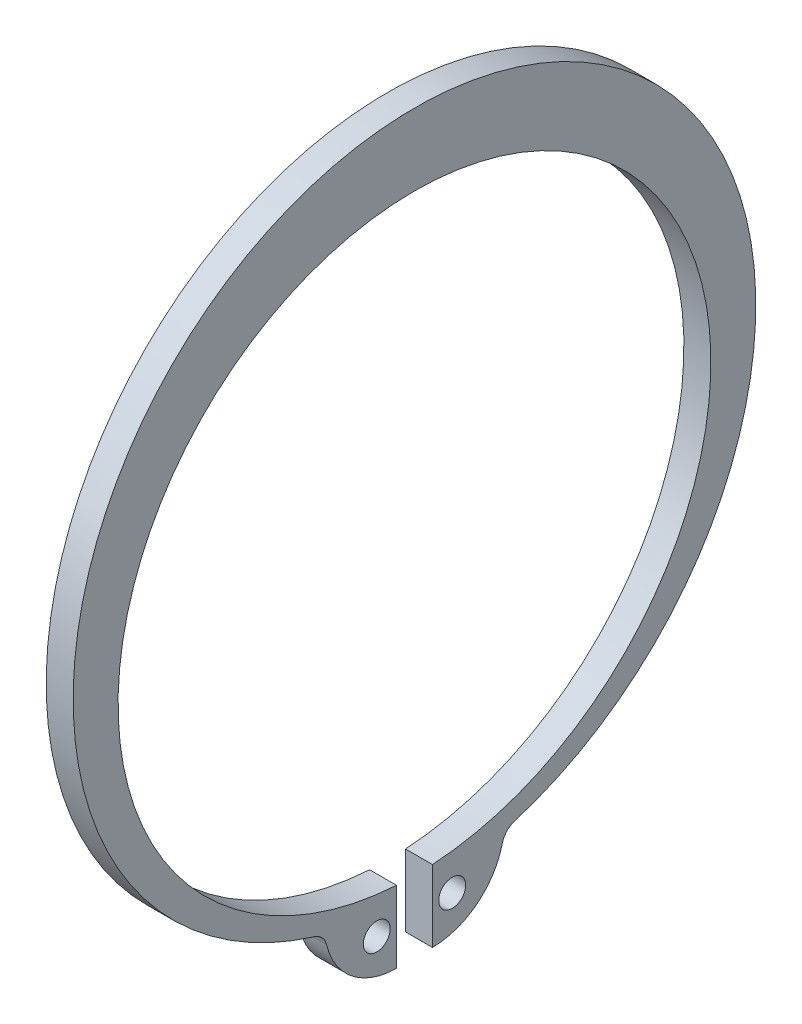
ISO-10303-21;
HEADER;
FILE_DESCRIPTION(('STEP AP214'),'2;1');
FILE_NAME('part.step','',(''),(''),'','','');
FILE_SCHEMA(('AUTOMOTIVE_DESIGN { 1 0 10303 214 1 1 1 1 }'));
ENDSEC;
DATA;
#1=APPLICATION_CONTEXT('core data for automotive mechanical design processes');
#2=APPLICATION_PROTOCOL_DEFINITION('international standard','automotive_design',2000,#1);
#3=PRODUCT_CONTEXT('',#1,'mechanical');
#4=PRODUCT('Part','Part','',(#3));
#5=PRODUCT_RELATED_PRODUCT_CATEGORY('part','',(#4));
#6=PRODUCT_DEFINITION_FORMATION('','',#4);
#7=PRODUCT_DEFINITION_CONTEXT('part definition',#1,'design');
#8=PRODUCT_DEFINITION('design','',#6,#7);
#9=PRODUCT_DEFINITION_SHAPE('','',#8);
#10=(LENGTH_UNIT() NAMED_UNIT(*) SI_UNIT(.MILLI.,.METRE.));
#11=(NAMED_UNIT(*) PLANE_ANGLE_UNIT() SI_UNIT($,.RADIAN.));
#12=(NAMED_UNIT(*) SI_UNIT($,.STERADIAN.) SOLID_ANGLE_UNIT());
#13=UNCERTAINTY_MEASURE_WITH_UNIT(LENGTH_MEASURE(1.E-05),#10,'distance_accuracy_value','');
#14=(GEOMETRIC_REPRESENTATION_CONTEXT(3) GLOBAL_UNCERTAINTY_ASSIGNED_CONTEXT((#13)) GLOBAL_UNIT_ASSIGNED_CONTEXT((#10,
#11,#12)) REPRESENTATION_CONTEXT('',''));
#15=CARTESIAN_POINT('',(0.,0.,0.));
#16=DIRECTION('',(0.,0.,1.));
#17=DIRECTION('',(1.,0.,0.));
#18=AXIS2_PLACEMENT_3D('',#15,#16,#17);
#19=CARTESIAN_POINT('',(1.5,1.5,0.));
#20=DIRECTION('',(1.,0.,0.));
#21=DIRECTION('',(0.,0.,-1.));
#22=AXIS2_PLACEMENT_3D('',#19,#20,#21);
#23=PLANE('',#22);
#24=CARTESIAN_POINT('',(1.5,-18.3847255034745,2.1));
#25=DIRECTION('',(1.,0.,0.));
#26=DIRECTION('',(0.,0.,-1.));
#27=AXIS2_PLACEMENT_3D('',#24,#25,#26);
#28=CIRCLE('',#27,0.75);
#29=CARTESIAN_POINT('',(1.5,-18.3847255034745,1.35));
#30=VERTEX_POINT('',#29);
#31=EDGE_CURVE('E115',#30,#30,#28,.T.);
#32=ORIENTED_EDGE('',*,*,#31,.F.);
#33=EDGE_LOOP('',(#32));
#34=FACE_BOUND('',#33,.T.);
#35=CARTESIAN_POINT('',(1.5,1.5,0.));
#36=DIRECTION('',(1.,0.,0.));
#37=DIRECTION('',(0.,0.,-1.));
#38=AXIS2_PLACEMENT_3D('',#35,#36,#37);
#39=CIRCLE('',#38,19.);
#40=CARTESIAN_POINT('',(1.5,-16.6644583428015,-5.57247280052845));
#41=VERTEX_POINT('',#40);
#42=CARTESIAN_POINT('',(1.5,-16.6644583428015,5.57247280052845));
#43=VERTEX_POINT('',#42);
#44=EDGE_CURVE('E133',#41,#43,#39,.T.);
#45=ORIENTED_EDGE('',*,*,#44,.T.);
#46=CARTESIAN_POINT('',(1.5,-17.6204824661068,5.86576084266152));
#47=DIRECTION('',(-1.,0.,0.));
#48=DIRECTION('',(0.,0.,1.));
#49=AXIS2_PLACEMENT_3D('',#46,#47,#48);
#50=CIRCLE('',#49,1.);
#51=CARTESIAN_POINT('',(1.5,-17.3903197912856,4.89260867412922));
#52=VERTEX_POINT('',#51);
#53=EDGE_CURVE('E110',#43,#52,#50,.T.);
#54=ORIENTED_EDGE('',*,*,#53,.T.);
#55=CARTESIAN_POINT('',(1.5,-16.4696690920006,1.));
#56=DIRECTION('',(1.,0.,0.));
#57=DIRECTION('',(0.,0.,-1.));
#58=AXIS2_PLACEMENT_3D('',#55,#56,#57);
#59=CIRCLE('',#58,4.);
#60=CARTESIAN_POINT('',(1.5,-20.4696690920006,1.));
#61=VERTEX_POINT('',#60);
#62=EDGE_CURVE('E136',#52,#61,#59,.T.);
#63=ORIENTED_EDGE('',*,*,#62,.T.);
#64=DIRECTION('',(0.,1.,0.));
#65=VECTOR('',#64,1.);
#66=CARTESIAN_POINT('',(1.5,-16.4696690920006,1.));
#67=LINE('',#66,#65);
#68=CARTESIAN_POINT('',(1.5,-16.4696690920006,1.));
#69=VERTEX_POINT('',#68);
#70=EDGE_CURVE('E138',#61,#69,#67,.T.);
#71=ORIENTED_EDGE('',*,*,#70,.T.);
#72=CARTESIAN_POINT('',(1.5,0.,0.));
#73=DIRECTION('',(-1.,0.,0.));
#74=DIRECTION('',(0.,0.,-1.));
#75=AXIS2_PLACEMENT_3D('',#72,#73,#74);
#76=CIRCLE('',#75,16.5);
#77=CARTESIAN_POINT('',(1.5,-16.4696690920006,-0.99999999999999));
#78=VERTEX_POINT('',#77);
#79=EDGE_CURVE('E140',#69,#78,#76,.T.);
#80=ORIENTED_EDGE('',*,*,#79,.T.);
#81=DIRECTION('',(0.,-1.,0.));
#82=VECTOR('',#81,1.);
#83=CARTESIAN_POINT('',(1.5,-16.4696690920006,-1.));
#84=LINE('',#83,#82);
#85=CARTESIAN_POINT('',(1.5,-20.4696690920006,-1.));
#86=VERTEX_POINT('',#85);
#87=EDGE_CURVE('E142',#78,#86,#84,.T.);
#88=ORIENTED_EDGE('',*,*,#87,.T.);
#89=CARTESIAN_POINT('',(1.5,-16.4696690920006,-1.));
#90=DIRECTION('',(1.,0.,0.));
#91=DIRECTION('',(0.,0.,-1.));
#92=AXIS2_PLACEMENT_3D('',#89,#90,#91);
#93=CIRCLE('',#92,4.);
#94=CARTESIAN_POINT('',(1.5,-17.3903197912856,-4.89260867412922));
#95=VERTEX_POINT('',#94);
#96=EDGE_CURVE('E51',#86,#95,#93,.T.);
#97=ORIENTED_EDGE('',*,*,#96,.T.);
#98=CARTESIAN_POINT('',(1.5,-17.6204824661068,-5.86576084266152));
#99=DIRECTION('',(-1.,0.,0.));
#100=DIRECTION('',(0.,0.,-1.));
#101=AXIS2_PLACEMENT_3D('',#98,#99,#100);
#102=CIRCLE('',#101,1.);
#103=EDGE_CURVE('E46',#95,#41,#102,.T.);
#104=ORIENTED_EDGE('',*,*,#103,.T.);
#105=EDGE_LOOP('',(#45,#54,#63,#71,#80,#88,#97,#104));
#106=FACE_BOUND('',#105,.T.);
#107=CARTESIAN_POINT('',(1.5,-18.3847255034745,-2.1));
#108=DIRECTION('',(1.,0.,0.));
#109=DIRECTION('',(0.,0.,-1.));
#110=AXIS2_PLACEMENT_3D('',#107,#108,#109);
#111=CIRCLE('',#110,0.75);
#112=CARTESIAN_POINT('',(1.5,-18.3847255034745,-2.85));
#113=VERTEX_POINT('',#112);
#114=EDGE_CURVE('E213',#113,#113,#111,.T.);
#115=ORIENTED_EDGE('',*,*,#114,.F.);
#116=EDGE_LOOP('',(#115));
#117=FACE_BOUND('',#116,.T.);
#118=ADVANCED_FACE('F31',(#34,#106,#117),#23,.T.);
#119=CARTESIAN_POINT('',(0.,1.5,0.));
#120=DIRECTION('',(1.,0.,0.));
#121=DIRECTION('',(0.,0.,-1.));
#122=AXIS2_PLACEMENT_3D('',#119,#120,#121);
#123=PLANE('',#122);
#124=CARTESIAN_POINT('',(0.,-18.3847255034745,2.1));
#125=DIRECTION('',(1.,0.,0.));
#126=DIRECTION('',(0.,0.,-1.));
#127=AXIS2_PLACEMENT_3D('',#124,#125,#126);
#128=CIRCLE('',#127,0.75);
#129=CARTESIAN_POINT('',(0.,-18.3847255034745,1.35));
#130=VERTEX_POINT('',#129);
#131=EDGE_CURVE('E118',#130,#130,#128,.T.);
#132=ORIENTED_EDGE('',*,*,#131,.T.);
#133=EDGE_LOOP('',(#132));
#134=FACE_BOUND('',#133,.T.);
#135=CARTESIAN_POINT('',(0.,1.5,0.));
#136=DIRECTION('',(1.,0.,0.));
#137=DIRECTION('',(0.,0.,-1.));
#138=AXIS2_PLACEMENT_3D('',#135,#136,#137);
#139=CIRCLE('',#138,19.);
#140=CARTESIAN_POINT('',(0.,-16.6644583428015,-5.57247280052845));
#141=VERTEX_POINT('',#140);
#142=CARTESIAN_POINT('',(0.,-16.6644583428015,5.57247280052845));
#143=VERTEX_POINT('',#142);
#144=EDGE_CURVE('E101',#141,#143,#139,.T.);
#145=ORIENTED_EDGE('',*,*,#144,.F.);
#146=CARTESIAN_POINT('',(0.,-17.6204824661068,-5.86576084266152));
#147=DIRECTION('',(-1.,0.,0.));
#148=DIRECTION('',(0.,0.,-1.));
#149=AXIS2_PLACEMENT_3D('',#146,#147,#148);
#150=CIRCLE('',#149,1.);
#151=CARTESIAN_POINT('',(0.,-17.3903197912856,-4.89260867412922));
#152=VERTEX_POINT('',#151);
#153=EDGE_CURVE('E131',#152,#141,#150,.T.);
#154=ORIENTED_EDGE('',*,*,#153,.F.);
#155=CARTESIAN_POINT('',(0.,-16.4696690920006,-1.));
#156=DIRECTION('',(1.,0.,0.));
#157=DIRECTION('',(0.,0.,-1.));
#158=AXIS2_PLACEMENT_3D('',#155,#156,#157);
#159=CIRCLE('',#158,4.);
#160=CARTESIAN_POINT('',(0.,-20.4696690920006,-1.));
#161=VERTEX_POINT('',#160);
#162=EDGE_CURVE('E129',#161,#152,#159,.T.);
#163=ORIENTED_EDGE('',*,*,#162,.F.);
#164=DIRECTION('',(0.,-1.,0.));
#165=VECTOR('',#164,1.);
#166=CARTESIAN_POINT('',(0.,-16.4696690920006,-1.));
#167=LINE('',#166,#165);
#168=CARTESIAN_POINT('',(0.,-16.4696690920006,-0.99999999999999));
#169=VERTEX_POINT('',#168);
#170=EDGE_CURVE('E127',#169,#161,#167,.T.);
#171=ORIENTED_EDGE('',*,*,#170,.F.);
#172=CARTESIAN_POINT('',(0.,0.,0.));
#173=DIRECTION('',(-1.,0.,0.));
#174=DIRECTION('',(0.,0.,-1.));
#175=AXIS2_PLACEMENT_3D('',#172,#173,#174);
#176=CIRCLE('',#175,16.5);
#177=CARTESIAN_POINT('',(0.,-16.4696690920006,1.));
#178=VERTEX_POINT('',#177);
#179=EDGE_CURVE('E125',#178,#169,#176,.T.);
#180=ORIENTED_EDGE('',*,*,#179,.F.);
#181=DIRECTION('',(0.,1.,0.));
#182=VECTOR('',#181,1.);
#183=CARTESIAN_POINT('',(0.,-16.4696690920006,1.));
#184=LINE('',#183,#182);
#185=CARTESIAN_POINT('',(0.,-20.4696690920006,1.));
#186=VERTEX_POINT('',#185);
#187=EDGE_CURVE('E123',#186,#178,#184,.T.);
#188=ORIENTED_EDGE('',*,*,#187,.F.);
#189=CARTESIAN_POINT('',(0.,-16.4696690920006,1.));
#190=DIRECTION('',(1.,0.,0.));
#191=DIRECTION('',(0.,0.,-1.));
#192=AXIS2_PLACEMENT_3D('',#189,#190,#191);
#193=CIRCLE('',#192,4.);
#194=CARTESIAN_POINT('',(0.,-17.3903197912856,4.89260867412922));
#195=VERTEX_POINT('',#194);
#196=EDGE_CURVE('E103',#195,#186,#193,.T.);
#197=ORIENTED_EDGE('',*,*,#196,.F.);
#198=CARTESIAN_POINT('',(0.,-17.6204824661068,5.86576084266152));
#199=DIRECTION('',(-1.,0.,0.));
#200=DIRECTION('',(0.,0.,1.));
#201=AXIS2_PLACEMENT_3D('',#198,#199,#200);
#202=CIRCLE('',#201,1.);
#203=EDGE_CURVE('E96',#143,#195,#202,.T.);
#204=ORIENTED_EDGE('',*,*,#203,.F.);
#205=EDGE_LOOP('',(#145,#154,#163,#171,#180,#188,#197,#204));
#206=FACE_BOUND('',#205,.T.);
#207=CARTESIAN_POINT('',(0.,-18.3847255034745,-2.1));
#208=DIRECTION('',(1.,0.,0.));
#209=DIRECTION('',(0.,0.,-1.));
#210=AXIS2_PLACEMENT_3D('',#207,#208,#209);
#211=CIRCLE('',#210,0.75);
#212=CARTESIAN_POINT('',(0.,-18.3847255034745,-2.85));
#213=VERTEX_POINT('',#212);
#214=EDGE_CURVE('E216',#213,#213,#211,.T.);
#215=ORIENTED_EDGE('',*,*,#214,.T.);
#216=EDGE_LOOP('',(#215));
#217=FACE_BOUND('',#216,.T.);
#218=ADVANCED_FACE('F97',(#134,#206,#217),#123,.F.);
#219=CARTESIAN_POINT('',(1.5,1.5,0.));
#220=DIRECTION('',(-1.,0.,0.));
#221=DIRECTION('',(0.,0.,1.));
#222=AXIS2_PLACEMENT_3D('',#219,#220,#221);
#223=CYLINDRICAL_SURFACE('',#222,19.);
#224=ORIENTED_EDGE('',*,*,#144,.T.);
#225=DIRECTION('',(-1.,0.,0.));
#226=VECTOR('',#225,1.);
#227=CARTESIAN_POINT('',(1.5,-16.6644583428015,5.57247280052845));
#228=LINE('',#227,#226);
#229=EDGE_CURVE('E11',#43,#143,#228,.T.);
#230=ORIENTED_EDGE('',*,*,#229,.F.);
#231=ORIENTED_EDGE('',*,*,#44,.F.);
#232=DIRECTION('',(-1.,0.,0.));
#233=VECTOR('',#232,1.);
#234=CARTESIAN_POINT('',(1.5,-16.6644583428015,-5.57247280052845));
#235=LINE('',#234,#233);
#236=EDGE_CURVE('E114',#41,#141,#235,.T.);
#237=ORIENTED_EDGE('',*,*,#236,.T.);
#238=EDGE_LOOP('',(#224,#230,#231,#237));
#239=FACE_BOUND('',#238,.T.);
#240=ADVANCED_FACE('F33',(#239),#223,.T.);
#241=CARTESIAN_POINT('',(1.5,-17.6204824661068,5.86576084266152));
#242=DIRECTION('',(-1.,0.,0.));
#243=DIRECTION('',(0.,0.,1.));
#244=AXIS2_PLACEMENT_3D('',#241,#242,#243);
#245=CYLINDRICAL_SURFACE('',#244,1.);
#246=ORIENTED_EDGE('',*,*,#203,.T.);
#247=DIRECTION('',(-1.,0.,0.));
#248=VECTOR('',#247,1.);
#249=CARTESIAN_POINT('',(1.5,-17.3903197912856,4.89260867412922));
#250=LINE('',#249,#248);
#251=EDGE_CURVE('E39',#52,#195,#250,.T.);
#252=ORIENTED_EDGE('',*,*,#251,.F.);
#253=ORIENTED_EDGE('',*,*,#53,.F.);
#254=ORIENTED_EDGE('',*,*,#229,.T.);
#255=EDGE_LOOP('',(#246,#252,#253,#254));
#256=FACE_BOUND('',#255,.T.);
#257=ADVANCED_FACE('F109',(#256),#245,.F.);
#258=CARTESIAN_POINT('',(1.5,-16.4696690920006,1.));
#259=DIRECTION('',(-1.,0.,0.));
#260=DIRECTION('',(0.,0.,1.));
#261=AXIS2_PLACEMENT_3D('',#258,#259,#260);
#262=CYLINDRICAL_SURFACE('',#261,4.);
#263=ORIENTED_EDGE('',*,*,#196,.T.);
#264=DIRECTION('',(-1.,0.,0.));
#265=VECTOR('',#264,1.);
#266=CARTESIAN_POINT('',(1.5,-20.4696690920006,1.));
#267=LINE('',#266,#265);
#268=EDGE_CURVE('E159',#61,#186,#267,.T.);
#269=ORIENTED_EDGE('',*,*,#268,.F.);
#270=ORIENTED_EDGE('',*,*,#62,.F.);
#271=ORIENTED_EDGE('',*,*,#251,.T.);
#272=EDGE_LOOP('',(#263,#269,#270,#271));
#273=FACE_BOUND('',#272,.T.);
#274=ADVANCED_FACE('F163',(#273),#262,.T.);
#275=CARTESIAN_POINT('',(1.5,-16.4696690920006,1.));
#276=DIRECTION('',(0.,0.,1.));
#277=DIRECTION('',(1.,0.,0.));
#278=AXIS2_PLACEMENT_3D('',#275,#276,#277);
#279=PLANE('',#278);
#280=ORIENTED_EDGE('',*,*,#187,.T.);
#281=DIRECTION('',(-1.,0.,0.));
#282=VECTOR('',#281,1.);
#283=CARTESIAN_POINT('',(1.5,-16.4696690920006,1.));
#284=LINE('',#283,#282);
#285=EDGE_CURVE('E156',#69,#178,#284,.T.);
#286=ORIENTED_EDGE('',*,*,#285,.F.);
#287=ORIENTED_EDGE('',*,*,#70,.F.);
#288=ORIENTED_EDGE('',*,*,#268,.T.);
#289=EDGE_LOOP('',(#280,#286,#287,#288));
#290=FACE_BOUND('',#289,.T.);
#291=ADVANCED_FACE('F171',(#290),#279,.F.);
#292=CARTESIAN_POINT('',(1.5,0.,0.));
#293=DIRECTION('',(-1.,0.,0.));
#294=DIRECTION('',(0.,0.,1.));
#295=AXIS2_PLACEMENT_3D('',#292,#293,#294);
#296=CYLINDRICAL_SURFACE('',#295,16.5);
#297=ORIENTED_EDGE('',*,*,#179,.T.);
#298=DIRECTION('',(-1.,0.,0.));
#299=VECTOR('',#298,1.);
#300=CARTESIAN_POINT('',(1.5,-16.4696690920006,-0.99999999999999));
#301=LINE('',#300,#299);
#302=EDGE_CURVE('E153',#78,#169,#301,.T.);
#303=ORIENTED_EDGE('',*,*,#302,.F.);
#304=ORIENTED_EDGE('',*,*,#79,.F.);
#305=ORIENTED_EDGE('',*,*,#285,.T.);
#306=EDGE_LOOP('',(#297,#303,#304,#305));
#307=FACE_BOUND('',#306,.T.);
#308=ADVANCED_FACE('F174',(#307),#296,.F.);
#309=CARTESIAN_POINT('',(1.5,-16.4696690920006,-1.));
#310=DIRECTION('',(0.,0.,-1.));
#311=DIRECTION('',(-1.,0.,0.));
#312=AXIS2_PLACEMENT_3D('',#309,#310,#311);
#313=PLANE('',#312);
#314=ORIENTED_EDGE('',*,*,#170,.T.);
#315=DIRECTION('',(-1.,0.,0.));
#316=VECTOR('',#315,1.);
#317=CARTESIAN_POINT('',(1.5,-20.4696690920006,-1.));
#318=LINE('',#317,#316);
#319=EDGE_CURVE('E150',#86,#161,#318,.T.);
#320=ORIENTED_EDGE('',*,*,#319,.F.);
#321=ORIENTED_EDGE('',*,*,#87,.F.);
#322=ORIENTED_EDGE('',*,*,#302,.T.);
#323=EDGE_LOOP('',(#314,#320,#321,#322));
#324=FACE_BOUND('',#323,.T.);
#325=ADVANCED_FACE('F179',(#324),#313,.F.);
#326=CARTESIAN_POINT('',(1.5,-16.4696690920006,-1.));
#327=DIRECTION('',(-1.,0.,0.));
#328=DIRECTION('',(0.,0.,1.));
#329=AXIS2_PLACEMENT_3D('',#326,#327,#328);
#330=CYLINDRICAL_SURFACE('',#329,4.);
#331=ORIENTED_EDGE('',*,*,#162,.T.);
#332=DIRECTION('',(-1.,0.,0.));
#333=VECTOR('',#332,1.);
#334=CARTESIAN_POINT('',(1.5,-17.3903197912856,-4.89260867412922));
#335=LINE('',#334,#333);
#336=EDGE_CURVE('E147',#95,#152,#335,.T.);
#337=ORIENTED_EDGE('',*,*,#336,.F.);
#338=ORIENTED_EDGE('',*,*,#96,.F.);
#339=ORIENTED_EDGE('',*,*,#319,.T.);
#340=EDGE_LOOP('',(#331,#337,#338,#339));
#341=FACE_BOUND('',#340,.T.);
#342=ADVANCED_FACE('F182',(#341),#330,.T.);
#343=CARTESIAN_POINT('',(1.5,-17.6204824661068,-5.86576084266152));
#344=DIRECTION('',(-1.,0.,0.));
#345=DIRECTION('',(0.,0.,1.));
#346=AXIS2_PLACEMENT_3D('',#343,#344,#345);
#347=CYLINDRICAL_SURFACE('',#346,1.);
#348=ORIENTED_EDGE('',*,*,#153,.T.);
#349=ORIENTED_EDGE('',*,*,#236,.F.);
#350=ORIENTED_EDGE('',*,*,#103,.F.);
#351=ORIENTED_EDGE('',*,*,#336,.T.);
#352=EDGE_LOOP('',(#348,#349,#350,#351));
#353=FACE_BOUND('',#352,.T.);
#354=ADVANCED_FACE('F184',(#353),#347,.F.);
#355=CARTESIAN_POINT('',(1.5,-18.3847255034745,2.1));
#356=DIRECTION('',(-1.,0.,0.));
#357=DIRECTION('',(0.,0.,1.));
#358=AXIS2_PLACEMENT_3D('',#355,#356,#357);
#359=CYLINDRICAL_SURFACE('',#358,0.75);
#360=ORIENTED_EDGE('',*,*,#31,.T.);
#361=EDGE_LOOP('',(#360));
#362=FACE_BOUND('',#361,.T.);
#363=ORIENTED_EDGE('',*,*,#131,.F.);
#364=EDGE_LOOP('',(#363));
#365=FACE_BOUND('',#364,.T.);
#366=ADVANCED_FACE('F186',(#362,#365),#359,.F.);
#367=CARTESIAN_POINT('',(1.5,-18.3847255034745,-2.1));
#368=DIRECTION('',(-1.,0.,0.));
#369=DIRECTION('',(0.,0.,1.));
#370=AXIS2_PLACEMENT_3D('',#367,#368,#369);
#371=CYLINDRICAL_SURFACE('',#370,0.75);
#372=ORIENTED_EDGE('',*,*,#114,.T.);
#373=EDGE_LOOP('',(#372));
#374=FACE_BOUND('',#373,.T.);
#375=ORIENTED_EDGE('',*,*,#214,.F.);
#376=EDGE_LOOP('',(#375));
#377=FACE_BOUND('',#376,.T.);
#378=ADVANCED_FACE('F192',(#374,#377),#371,.F.);
#379=CLOSED_SHELL('',(#118,#218,#240,#257,#274,#291,#308,#325,#342,#354,#366,#378));
#380=MANIFOLD_SOLID_BREP('B2',#379);
#381=ADVANCED_BREP_SHAPE_REPRESENTATION('',(#18,#380),#14);
#382=SHAPE_DEFINITION_REPRESENTATION(#9,#381);
ENDSEC;
END-ISO-10303-21;
